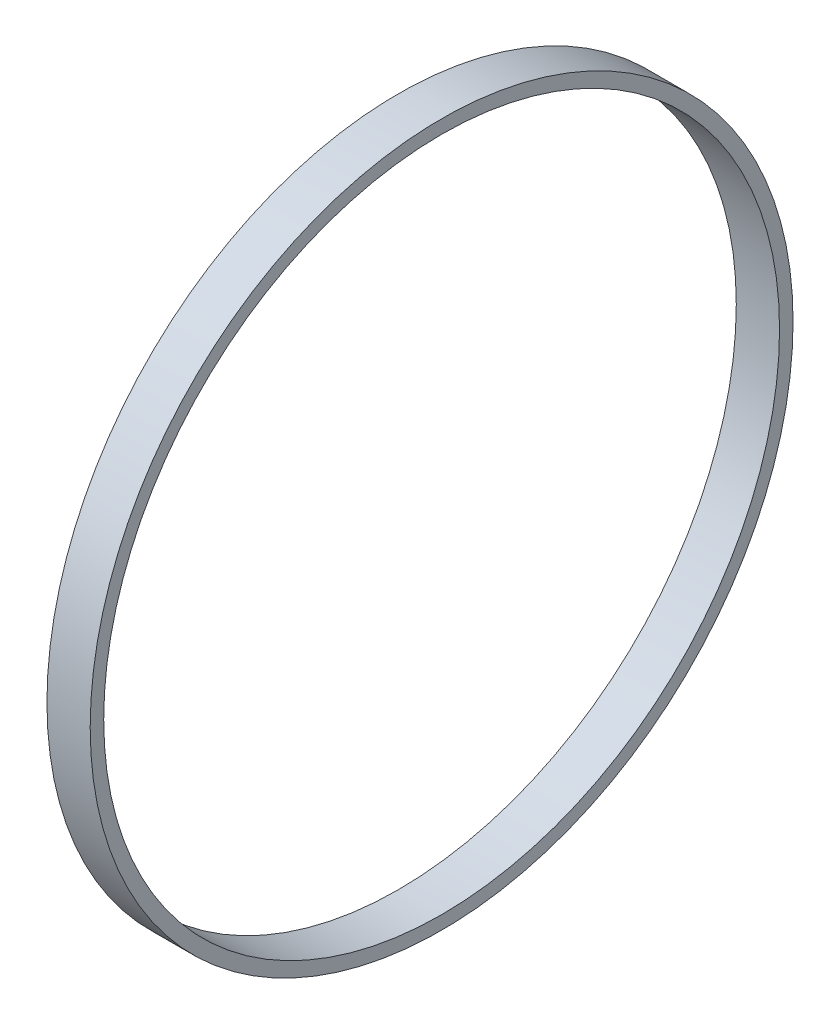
ISO-10303-21;
HEADER;
FILE_DESCRIPTION(('STEP AP214'),'2;1');
FILE_NAME('part.step','',(''),(''),'','','');
FILE_SCHEMA(('AUTOMOTIVE_DESIGN { 1 0 10303 214 1 1 1 1 }'));
ENDSEC;
DATA;
#1=APPLICATION_CONTEXT('core data for automotive mechanical design processes');
#2=APPLICATION_PROTOCOL_DEFINITION('international standard','automotive_design',2000,#1);
#3=PRODUCT_CONTEXT('',#1,'mechanical');
#4=PRODUCT('Part','Part','',(#3));
#5=PRODUCT_RELATED_PRODUCT_CATEGORY('part','',(#4));
#6=PRODUCT_DEFINITION_FORMATION('','',#4);
#7=PRODUCT_DEFINITION_CONTEXT('part definition',#1,'design');
#8=PRODUCT_DEFINITION('design','',#6,#7);
#9=PRODUCT_DEFINITION_SHAPE('','',#8);
#10=(LENGTH_UNIT() NAMED_UNIT(*) SI_UNIT(.MILLI.,.METRE.));
#11=(NAMED_UNIT(*) PLANE_ANGLE_UNIT() SI_UNIT($,.RADIAN.));
#12=(NAMED_UNIT(*) SI_UNIT($,.STERADIAN.) SOLID_ANGLE_UNIT());
#13=UNCERTAINTY_MEASURE_WITH_UNIT(LENGTH_MEASURE(1.E-05),#10,'distance_accuracy_value','');
#14=(GEOMETRIC_REPRESENTATION_CONTEXT(3) GLOBAL_UNCERTAINTY_ASSIGNED_CONTEXT((#13)) GLOBAL_UNIT_ASSIGNED_CONTEXT((#10,
#11,#12)) REPRESENTATION_CONTEXT('',''));
#15=CARTESIAN_POINT('',(0.,0.,0.));
#16=DIRECTION('',(0.,0.,1.));
#17=DIRECTION('',(1.,0.,0.));
#18=AXIS2_PLACEMENT_3D('',#15,#16,#17);
#19=CARTESIAN_POINT('',(10.16,0.,0.));
#20=DIRECTION('',(1.,0.,0.));
#21=DIRECTION('',(0.,0.,-1.));
#22=AXIS2_PLACEMENT_3D('',#19,#20,#21);
#23=PLANE('',#22);
#24=CARTESIAN_POINT('',(10.16,0.,0.));
#25=DIRECTION('',(1.,0.,0.));
#26=DIRECTION('',(0.,0.,-1.));
#27=AXIS2_PLACEMENT_3D('',#24,#25,#26);
#28=CIRCLE('',#27,82.55);
#29=CARTESIAN_POINT('',(10.16,0.,-82.55));
#30=VERTEX_POINT('',#29);
#31=EDGE_CURVE('E10',#30,#30,#28,.T.);
#32=ORIENTED_EDGE('',*,*,#31,.T.);
#33=EDGE_LOOP('',(#32));
#34=FACE_BOUND('',#33,.T.);
#35=CARTESIAN_POINT('',(10.16,0.,0.));
#36=DIRECTION('',(1.,0.,0.));
#37=DIRECTION('',(0.,0.,-1.));
#38=AXIS2_PLACEMENT_3D('',#35,#36,#37);
#39=CIRCLE('',#38,79.375);
#40=CARTESIAN_POINT('',(10.16,0.,-79.375));
#41=VERTEX_POINT('',#40);
#42=EDGE_CURVE('E54',#41,#41,#39,.T.);
#43=ORIENTED_EDGE('',*,*,#42,.F.);
#44=EDGE_LOOP('',(#43));
#45=FACE_BOUND('',#44,.T.);
#46=ADVANCED_FACE('F41',(#34,#45),#23,.T.);
#47=CARTESIAN_POINT('',(0.,0.,0.));
#48=DIRECTION('',(1.,0.,0.));
#49=DIRECTION('',(0.,0.,-1.));
#50=AXIS2_PLACEMENT_3D('',#47,#48,#49);
#51=PLANE('',#50);
#52=CARTESIAN_POINT('',(0.,0.,0.));
#53=DIRECTION('',(1.,0.,0.));
#54=DIRECTION('',(0.,0.,-1.));
#55=AXIS2_PLACEMENT_3D('',#52,#53,#54);
#56=CIRCLE('',#55,82.55);
#57=CARTESIAN_POINT('',(0.,0.,-82.55));
#58=VERTEX_POINT('',#57);
#59=EDGE_CURVE('E44',#58,#58,#56,.T.);
#60=ORIENTED_EDGE('',*,*,#59,.F.);
#61=EDGE_LOOP('',(#60));
#62=FACE_BOUND('',#61,.T.);
#63=CARTESIAN_POINT('',(0.,0.,0.));
#64=DIRECTION('',(1.,0.,0.));
#65=DIRECTION('',(0.,0.,-1.));
#66=AXIS2_PLACEMENT_3D('',#63,#64,#65);
#67=CIRCLE('',#66,79.375);
#68=CARTESIAN_POINT('',(0.,0.,-79.375));
#69=VERTEX_POINT('',#68);
#70=EDGE_CURVE('E60',#69,#69,#67,.T.);
#71=ORIENTED_EDGE('',*,*,#70,.T.);
#72=EDGE_LOOP('',(#71));
#73=FACE_BOUND('',#72,.T.);
#74=ADVANCED_FACE('F68',(#62,#73),#51,.F.);
#75=CARTESIAN_POINT('',(10.16,0.,0.));
#76=DIRECTION('',(-1.,0.,0.));
#77=DIRECTION('',(0.,0.,1.));
#78=AXIS2_PLACEMENT_3D('',#75,#76,#77);
#79=CYLINDRICAL_SURFACE('',#78,82.55);
#80=ORIENTED_EDGE('',*,*,#31,.F.);
#81=EDGE_LOOP('',(#80));
#82=FACE_BOUND('',#81,.T.);
#83=ORIENTED_EDGE('',*,*,#59,.T.);
#84=EDGE_LOOP('',(#83));
#85=FACE_BOUND('',#84,.T.);
#86=ADVANCED_FACE('F43',(#82,#85),#79,.T.);
#87=CARTESIAN_POINT('',(10.16,0.,0.));
#88=DIRECTION('',(-1.,0.,0.));
#89=DIRECTION('',(0.,0.,1.));
#90=AXIS2_PLACEMENT_3D('',#87,#88,#89);
#91=CYLINDRICAL_SURFACE('',#90,79.375);
#92=ORIENTED_EDGE('',*,*,#42,.T.);
#93=EDGE_LOOP('',(#92));
#94=FACE_BOUND('',#93,.T.);
#95=ORIENTED_EDGE('',*,*,#70,.F.);
#96=EDGE_LOOP('',(#95));
#97=FACE_BOUND('',#96,.T.);
#98=ADVANCED_FACE('F67',(#94,#97),#91,.F.);
#99=CLOSED_SHELL('',(#46,#74,#86,#98));
#100=MANIFOLD_SOLID_BREP('B2',#99);
#101=ADVANCED_BREP_SHAPE_REPRESENTATION('',(#18,#100),#14);
#102=SHAPE_DEFINITION_REPRESENTATION(#9,#101);
ENDSEC;
END-ISO-10303-21;
